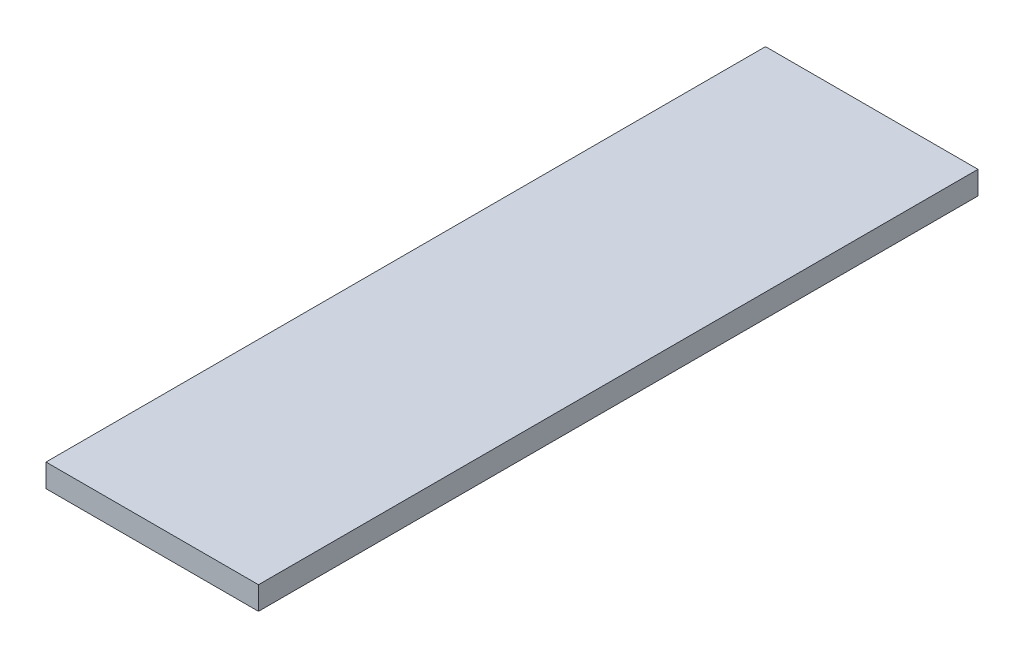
ISO-10303-21;
HEADER;
FILE_DESCRIPTION(('STEP AP214'),'2;1');
FILE_NAME('part.step','',(''),(''),'','','');
FILE_SCHEMA(('AUTOMOTIVE_DESIGN { 1 0 10303 214 1 1 1 1 }'));
ENDSEC;
DATA;
#1=APPLICATION_CONTEXT('core data for automotive mechanical design processes');
#2=APPLICATION_PROTOCOL_DEFINITION('international standard','automotive_design',2000,#1);
#3=PRODUCT_CONTEXT('',#1,'mechanical');
#4=PRODUCT('Part','Part','',(#3));
#5=PRODUCT_RELATED_PRODUCT_CATEGORY('part','',(#4));
#6=PRODUCT_DEFINITION_FORMATION('','',#4);
#7=PRODUCT_DEFINITION_CONTEXT('part definition',#1,'design');
#8=PRODUCT_DEFINITION('design','',#6,#7);
#9=PRODUCT_DEFINITION_SHAPE('','',#8);
#10=(LENGTH_UNIT() NAMED_UNIT(*) SI_UNIT(.MILLI.,.METRE.));
#11=(NAMED_UNIT(*) PLANE_ANGLE_UNIT() SI_UNIT($,.RADIAN.));
#12=(NAMED_UNIT(*) SI_UNIT($,.STERADIAN.) SOLID_ANGLE_UNIT());
#13=UNCERTAINTY_MEASURE_WITH_UNIT(LENGTH_MEASURE(1.E-05),#10,'distance_accuracy_value','');
#14=(GEOMETRIC_REPRESENTATION_CONTEXT(3) GLOBAL_UNCERTAINTY_ASSIGNED_CONTEXT((#13)) GLOBAL_UNIT_ASSIGNED_CONTEXT((#10,
#11,#12)) REPRESENTATION_CONTEXT('',''));
#15=CARTESIAN_POINT('',(0.,0.,0.));
#16=DIRECTION('',(0.,0.,1.));
#17=DIRECTION('',(1.,0.,0.));
#18=AXIS2_PLACEMENT_3D('',#15,#16,#17);
#19=CARTESIAN_POINT('',(584.2,127.,-1978.07072));
#20=DIRECTION('',(-1.,0.,0.));
#21=DIRECTION('',(0.,0.,1.));
#22=AXIS2_PLACEMENT_3D('',#19,#20,#21);
#23=PLANE('',#22);
#24=DIRECTION('',(0.,0.,-1.));
#25=VECTOR('',#24,1.);
#26=CARTESIAN_POINT('',(584.2,0.,-1978.07072));
#27=LINE('',#26,#25);
#28=CARTESIAN_POINT('',(584.2,0.,1978.07072));
#29=VERTEX_POINT('',#28);
#30=CARTESIAN_POINT('',(584.2,0.,-1978.07072));
#31=VERTEX_POINT('',#30);
#32=EDGE_CURVE('E101',#29,#31,#27,.T.);
#33=ORIENTED_EDGE('',*,*,#32,.T.);
#34=DIRECTION('',(0.,-1.,0.));
#35=VECTOR('',#34,1.);
#36=CARTESIAN_POINT('',(584.2,127.,-1978.07072));
#37=LINE('',#36,#35);
#38=CARTESIAN_POINT('',(584.2,127.,-1978.07072));
#39=VERTEX_POINT('',#38);
#40=EDGE_CURVE('E11',#39,#31,#37,.T.);
#41=ORIENTED_EDGE('',*,*,#40,.F.);
#42=DIRECTION('',(0.,0.,-1.));
#43=VECTOR('',#42,1.);
#44=CARTESIAN_POINT('',(584.2,127.,-1978.07072));
#45=LINE('',#44,#43);
#46=CARTESIAN_POINT('',(584.2,127.,1978.07072));
#47=VERTEX_POINT('',#46);
#48=EDGE_CURVE('E87',#47,#39,#45,.T.);
#49=ORIENTED_EDGE('',*,*,#48,.F.);
#50=DIRECTION('',(0.,-1.,0.));
#51=VECTOR('',#50,1.);
#52=CARTESIAN_POINT('',(584.2,127.,1978.07072));
#53=LINE('',#52,#51);
#54=EDGE_CURVE('E97',#47,#29,#53,.T.);
#55=ORIENTED_EDGE('',*,*,#54,.T.);
#56=EDGE_LOOP('',(#33,#41,#49,#55));
#57=FACE_BOUND('',#56,.T.);
#58=ADVANCED_FACE('F36',(#57),#23,.F.);
#59=CARTESIAN_POINT('',(-584.2,127.,-1978.07072));
#60=DIRECTION('',(0.,0.,1.));
#61=DIRECTION('',(1.,0.,0.));
#62=AXIS2_PLACEMENT_3D('',#59,#60,#61);
#63=PLANE('',#62);
#64=DIRECTION('',(-1.,0.,0.));
#65=VECTOR('',#64,1.);
#66=CARTESIAN_POINT('',(-584.2,0.,-1978.07072));
#67=LINE('',#66,#65);
#68=CARTESIAN_POINT('',(-584.2,0.,-1978.07072));
#69=VERTEX_POINT('',#68);
#70=EDGE_CURVE('E91',#31,#69,#67,.T.);
#71=ORIENTED_EDGE('',*,*,#70,.T.);
#72=DIRECTION('',(0.,-1.,0.));
#73=VECTOR('',#72,1.);
#74=CARTESIAN_POINT('',(-584.2,127.,-1978.07072));
#75=LINE('',#74,#73);
#76=CARTESIAN_POINT('',(-584.2,127.,-1978.07072));
#77=VERTEX_POINT('',#76);
#78=EDGE_CURVE('E44',#77,#69,#75,.T.);
#79=ORIENTED_EDGE('',*,*,#78,.F.);
#80=DIRECTION('',(-1.,0.,0.));
#81=VECTOR('',#80,1.);
#82=CARTESIAN_POINT('',(-584.2,127.,-1978.07072));
#83=LINE('',#82,#81);
#84=EDGE_CURVE('E82',#39,#77,#83,.T.);
#85=ORIENTED_EDGE('',*,*,#84,.F.);
#86=ORIENTED_EDGE('',*,*,#40,.T.);
#87=EDGE_LOOP('',(#71,#79,#85,#86));
#88=FACE_BOUND('',#87,.T.);
#89=ADVANCED_FACE('F90',(#88),#63,.F.);
#90=CARTESIAN_POINT('',(-584.2,127.,-1978.07072));
#91=DIRECTION('',(1.,0.,0.));
#92=DIRECTION('',(0.,0.,-1.));
#93=AXIS2_PLACEMENT_3D('',#90,#91,#92);
#94=PLANE('',#93);
#95=DIRECTION('',(0.,0.,1.));
#96=VECTOR('',#95,1.);
#97=CARTESIAN_POINT('',(-584.2,0.,-1978.07072));
#98=LINE('',#97,#96);
#99=CARTESIAN_POINT('',(-584.2,0.,1978.07072));
#100=VERTEX_POINT('',#99);
#101=EDGE_CURVE('E69',#69,#100,#98,.T.);
#102=ORIENTED_EDGE('',*,*,#101,.T.);
#103=DIRECTION('',(0.,-1.,0.));
#104=VECTOR('',#103,1.);
#105=CARTESIAN_POINT('',(-584.2,127.,1978.07072));
#106=LINE('',#105,#104);
#107=CARTESIAN_POINT('',(-584.2,127.,1978.07072));
#108=VERTEX_POINT('',#107);
#109=EDGE_CURVE('E92',#108,#100,#106,.T.);
#110=ORIENTED_EDGE('',*,*,#109,.F.);
#111=DIRECTION('',(0.,0.,1.));
#112=VECTOR('',#111,1.);
#113=CARTESIAN_POINT('',(-584.2,127.,-1978.07072));
#114=LINE('',#113,#112);
#115=EDGE_CURVE('E85',#77,#108,#114,.T.);
#116=ORIENTED_EDGE('',*,*,#115,.F.);
#117=ORIENTED_EDGE('',*,*,#78,.T.);
#118=EDGE_LOOP('',(#102,#110,#116,#117));
#119=FACE_BOUND('',#118,.T.);
#120=ADVANCED_FACE('F93',(#119),#94,.F.);
#121=CARTESIAN_POINT('',(-584.2,127.,1978.07072));
#122=DIRECTION('',(0.,0.,-1.));
#123=DIRECTION('',(-1.,0.,0.));
#124=AXIS2_PLACEMENT_3D('',#121,#122,#123);
#125=PLANE('',#124);
#126=DIRECTION('',(1.,0.,0.));
#127=VECTOR('',#126,1.);
#128=CARTESIAN_POINT('',(-584.2,0.,1978.07072));
#129=LINE('',#128,#127);
#130=EDGE_CURVE('E75',#100,#29,#129,.T.);
#131=ORIENTED_EDGE('',*,*,#130,.T.);
#132=ORIENTED_EDGE('',*,*,#54,.F.);
#133=DIRECTION('',(1.,0.,0.));
#134=VECTOR('',#133,1.);
#135=CARTESIAN_POINT('',(-584.2,127.,1978.07072));
#136=LINE('',#135,#134);
#137=EDGE_CURVE('E52',#108,#47,#136,.T.);
#138=ORIENTED_EDGE('',*,*,#137,.F.);
#139=ORIENTED_EDGE('',*,*,#109,.T.);
#140=EDGE_LOOP('',(#131,#132,#138,#139));
#141=FACE_BOUND('',#140,.T.);
#142=ADVANCED_FACE('F108',(#141),#125,.F.);
#143=CARTESIAN_POINT('',(584.2,127.,1978.07072));
#144=DIRECTION('',(0.,1.,0.));
#145=DIRECTION('',(0.,0.,1.));
#146=AXIS2_PLACEMENT_3D('',#143,#144,#145);
#147=PLANE('',#146);
#148=ORIENTED_EDGE('',*,*,#48,.T.);
#149=ORIENTED_EDGE('',*,*,#84,.T.);
#150=ORIENTED_EDGE('',*,*,#115,.T.);
#151=ORIENTED_EDGE('',*,*,#137,.T.);
#152=EDGE_LOOP('',(#148,#149,#150,#151));
#153=FACE_BOUND('',#152,.T.);
#154=ADVANCED_FACE('F83',(#153),#147,.T.);
#155=CARTESIAN_POINT('',(584.2,0.,1978.07072));
#156=DIRECTION('',(0.,1.,0.));
#157=DIRECTION('',(0.,0.,1.));
#158=AXIS2_PLACEMENT_3D('',#155,#156,#157);
#159=PLANE('',#158);
#160=ORIENTED_EDGE('',*,*,#32,.F.);
#161=ORIENTED_EDGE('',*,*,#130,.F.);
#162=ORIENTED_EDGE('',*,*,#101,.F.);
#163=ORIENTED_EDGE('',*,*,#70,.F.);
#164=EDGE_LOOP('',(#160,#161,#162,#163));
#165=FACE_BOUND('',#164,.T.);
#166=ADVANCED_FACE('F111',(#165),#159,.F.);
#167=CLOSED_SHELL('',(#58,#89,#120,#142,#154,#166));
#168=MANIFOLD_SOLID_BREP('B2',#167);
#169=ADVANCED_BREP_SHAPE_REPRESENTATION('',(#18,#168),#14);
#170=SHAPE_DEFINITION_REPRESENTATION(#9,#169);
ENDSEC;
END-ISO-10303-21;
